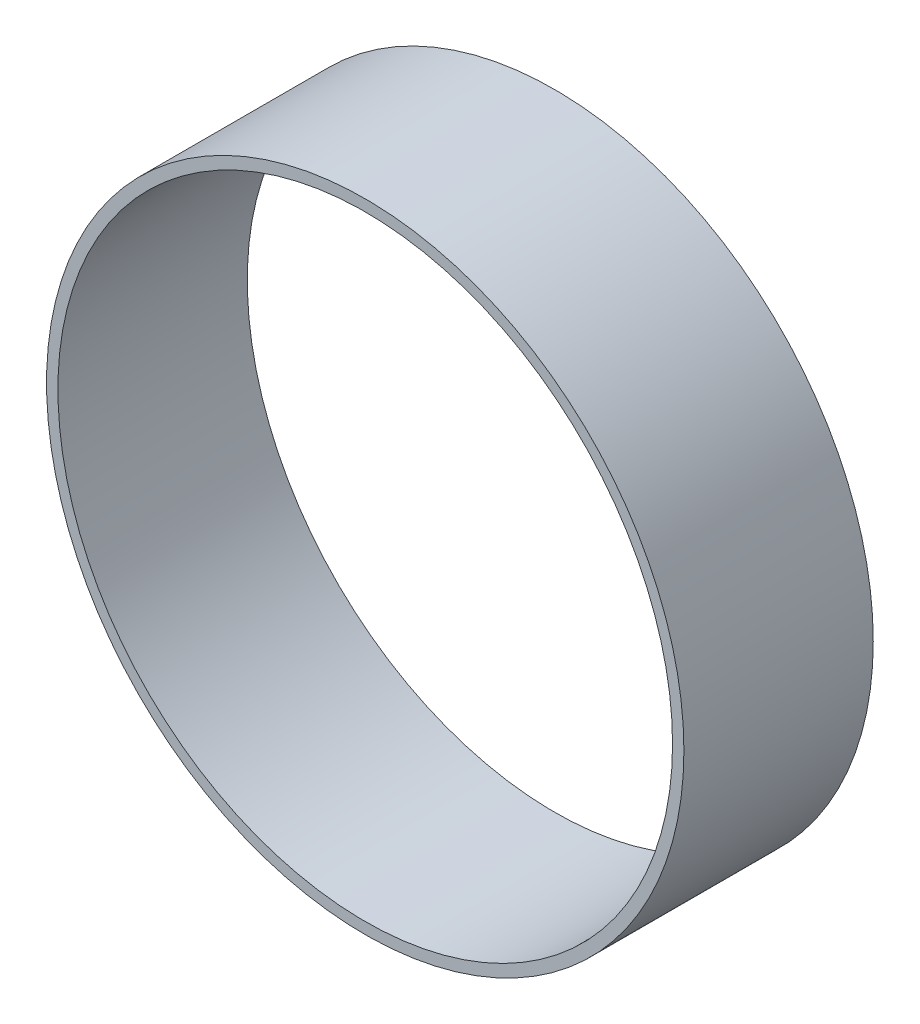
ISO-10303-21;
HEADER;
FILE_DESCRIPTION(('STEP AP214'),'2;1');
FILE_NAME('part.step','',(''),(''),'','','');
FILE_SCHEMA(('AUTOMOTIVE_DESIGN { 1 0 10303 214 1 1 1 1 }'));
ENDSEC;
DATA;
#1=APPLICATION_CONTEXT('core data for automotive mechanical design processes');
#2=APPLICATION_PROTOCOL_DEFINITION('international standard','automotive_design',2000,#1);
#3=PRODUCT_CONTEXT('',#1,'mechanical');
#4=PRODUCT('Part','Part','',(#3));
#5=PRODUCT_RELATED_PRODUCT_CATEGORY('part','',(#4));
#6=PRODUCT_DEFINITION_FORMATION('','',#4);
#7=PRODUCT_DEFINITION_CONTEXT('part definition',#1,'design');
#8=PRODUCT_DEFINITION('design','',#6,#7);
#9=PRODUCT_DEFINITION_SHAPE('','',#8);
#10=(LENGTH_UNIT() NAMED_UNIT(*) SI_UNIT(.MILLI.,.METRE.));
#11=(NAMED_UNIT(*) PLANE_ANGLE_UNIT() SI_UNIT($,.RADIAN.));
#12=(NAMED_UNIT(*) SI_UNIT($,.STERADIAN.) SOLID_ANGLE_UNIT());
#13=UNCERTAINTY_MEASURE_WITH_UNIT(LENGTH_MEASURE(1.E-05),#10,'distance_accuracy_value','');
#14=(GEOMETRIC_REPRESENTATION_CONTEXT(3) GLOBAL_UNCERTAINTY_ASSIGNED_CONTEXT((#13)) GLOBAL_UNIT_ASSIGNED_CONTEXT((#10,
#11,#12)) REPRESENTATION_CONTEXT('',''));
#15=CARTESIAN_POINT('',(0.,0.,0.));
#16=DIRECTION('',(0.,0.,1.));
#17=DIRECTION('',(1.,0.,0.));
#18=AXIS2_PLACEMENT_3D('',#15,#16,#17);
#19=CARTESIAN_POINT('',(0.,0.,0.));
#20=DIRECTION('',(0.,0.,-1.));
#21=DIRECTION('',(-1.,0.,0.));
#22=AXIS2_PLACEMENT_3D('',#19,#20,#21);
#23=CYLINDRICAL_SURFACE('',#22,84.15);
#24=CARTESIAN_POINT('',(0.,0.,-50.));
#25=DIRECTION('',(0.,0.,1.));
#26=DIRECTION('',(1.,0.,0.));
#27=AXIS2_PLACEMENT_3D('',#24,#25,#26);
#28=CIRCLE('',#27,84.15);
#29=CARTESIAN_POINT('',(84.15,0.,-50.));
#30=VERTEX_POINT('',#29);
#31=EDGE_CURVE('E51',#30,#30,#28,.T.);
#32=ORIENTED_EDGE('',*,*,#31,.T.);
#33=EDGE_LOOP('',(#32));
#34=FACE_BOUND('',#33,.T.);
#35=CARTESIAN_POINT('',(0.,0.,0.));
#36=DIRECTION('',(0.,0.,1.));
#37=DIRECTION('',(1.,0.,0.));
#38=AXIS2_PLACEMENT_3D('',#35,#36,#37);
#39=CIRCLE('',#38,84.15);
#40=CARTESIAN_POINT('',(84.15,0.,0.));
#41=VERTEX_POINT('',#40);
#42=EDGE_CURVE('E36',#41,#41,#39,.T.);
#43=ORIENTED_EDGE('',*,*,#42,.F.);
#44=EDGE_LOOP('',(#43));
#45=FACE_BOUND('',#44,.T.);
#46=ADVANCED_FACE('F33',(#34,#45),#23,.T.);
#47=CARTESIAN_POINT('',(0.,0.,0.));
#48=DIRECTION('',(0.,0.,1.));
#49=DIRECTION('',(1.,0.,0.));
#50=AXIS2_PLACEMENT_3D('',#47,#48,#49);
#51=PLANE('',#50);
#52=CARTESIAN_POINT('',(0.,0.,0.));
#53=DIRECTION('',(0.,0.,1.));
#54=DIRECTION('',(1.,0.,0.));
#55=AXIS2_PLACEMENT_3D('',#52,#53,#54);
#56=CIRCLE('',#55,81.15);
#57=CARTESIAN_POINT('',(81.15,0.,0.));
#58=VERTEX_POINT('',#57);
#59=EDGE_CURVE('E41',#58,#58,#56,.F.);
#60=ORIENTED_EDGE('',*,*,#59,.T.);
#61=EDGE_LOOP('',(#60));
#62=FACE_BOUND('',#61,.T.);
#63=ORIENTED_EDGE('',*,*,#42,.T.);
#64=EDGE_LOOP('',(#63));
#65=FACE_BOUND('',#64,.T.);
#66=ADVANCED_FACE('F63',(#62,#65),#51,.T.);
#67=CARTESIAN_POINT('',(0.,0.,-50.));
#68=DIRECTION('',(0.,0.,1.));
#69=DIRECTION('',(1.,0.,0.));
#70=AXIS2_PLACEMENT_3D('',#67,#68,#69);
#71=PLANE('',#70);
#72=CARTESIAN_POINT('',(0.,0.,-50.));
#73=DIRECTION('',(0.,0.,1.));
#74=DIRECTION('',(1.,0.,0.));
#75=AXIS2_PLACEMENT_3D('',#72,#73,#74);
#76=CIRCLE('',#75,81.15);
#77=CARTESIAN_POINT('',(81.15,0.,-50.));
#78=VERTEX_POINT('',#77);
#79=EDGE_CURVE('E11',#78,#78,#76,.F.);
#80=ORIENTED_EDGE('',*,*,#79,.F.);
#81=EDGE_LOOP('',(#80));
#82=FACE_BOUND('',#81,.T.);
#83=ORIENTED_EDGE('',*,*,#31,.F.);
#84=EDGE_LOOP('',(#83));
#85=FACE_BOUND('',#84,.T.);
#86=ADVANCED_FACE('F61',(#82,#85),#71,.F.);
#87=CARTESIAN_POINT('',(0.,0.,0.));
#88=DIRECTION('',(0.,0.,-1.));
#89=DIRECTION('',(-1.,0.,0.));
#90=AXIS2_PLACEMENT_3D('',#87,#88,#89);
#91=CYLINDRICAL_SURFACE('',#90,81.15);
#92=ORIENTED_EDGE('',*,*,#79,.T.);
#93=EDGE_LOOP('',(#92));
#94=FACE_BOUND('',#93,.T.);
#95=ORIENTED_EDGE('',*,*,#59,.F.);
#96=EDGE_LOOP('',(#95));
#97=FACE_BOUND('',#96,.T.);
#98=ADVANCED_FACE('F58',(#94,#97),#91,.F.);
#99=CLOSED_SHELL('',(#46,#66,#86,#98));
#100=MANIFOLD_SOLID_BREP('B2',#99);
#101=ADVANCED_BREP_SHAPE_REPRESENTATION('',(#18,#100),#14);
#102=SHAPE_DEFINITION_REPRESENTATION(#9,#101);
ENDSEC;
END-ISO-10303-21;
